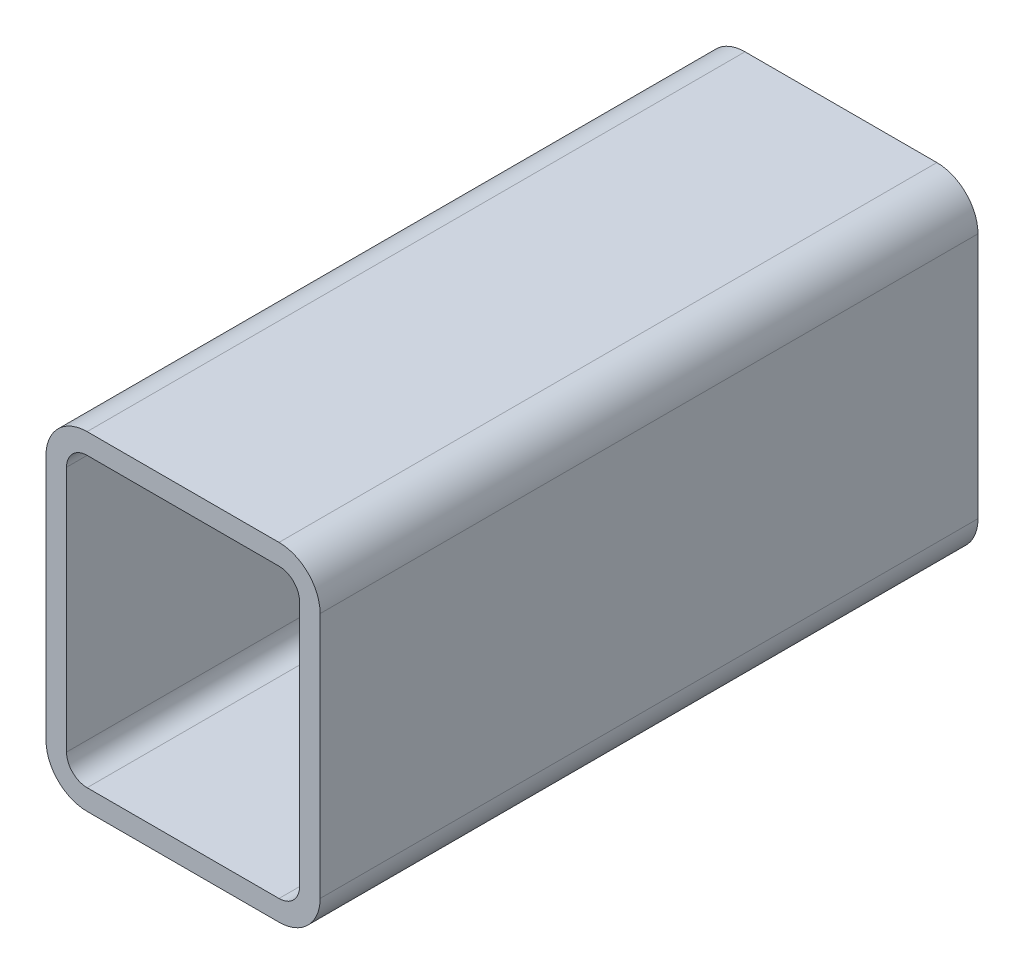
ISO-10303-21;
HEADER;
FILE_DESCRIPTION(('STEP AP214'),'2;1');
FILE_NAME('part.step','',(''),(''),'','','');
FILE_SCHEMA(('AUTOMOTIVE_DESIGN { 1 0 10303 214 1 1 1 1 }'));
ENDSEC;
DATA;
#1=APPLICATION_CONTEXT('core data for automotive mechanical design processes');
#2=APPLICATION_PROTOCOL_DEFINITION('international standard','automotive_design',2000,#1);
#3=PRODUCT_CONTEXT('',#1,'mechanical');
#4=PRODUCT('Part','Part','',(#3));
#5=PRODUCT_RELATED_PRODUCT_CATEGORY('part','',(#4));
#6=PRODUCT_DEFINITION_FORMATION('','',#4);
#7=PRODUCT_DEFINITION_CONTEXT('part definition',#1,'design');
#8=PRODUCT_DEFINITION('design','',#6,#7);
#9=PRODUCT_DEFINITION_SHAPE('','',#8);
#10=(LENGTH_UNIT() NAMED_UNIT(*) SI_UNIT(.MILLI.,.METRE.));
#11=(NAMED_UNIT(*) PLANE_ANGLE_UNIT() SI_UNIT($,.RADIAN.));
#12=(NAMED_UNIT(*) SI_UNIT($,.STERADIAN.) SOLID_ANGLE_UNIT());
#13=UNCERTAINTY_MEASURE_WITH_UNIT(LENGTH_MEASURE(1.E-05),#10,'distance_accuracy_value','');
#14=(GEOMETRIC_REPRESENTATION_CONTEXT(3) GLOBAL_UNCERTAINTY_ASSIGNED_CONTEXT((#13)) GLOBAL_UNIT_ASSIGNED_CONTEXT((#10,
#11,#12)) REPRESENTATION_CONTEXT('',''));
#15=CARTESIAN_POINT('',(0.,0.,0.));
#16=DIRECTION('',(0.,0.,1.));
#17=DIRECTION('',(1.,0.,0.));
#18=AXIS2_PLACEMENT_3D('',#15,#16,#17);
#19=CARTESIAN_POINT('',(19.9112396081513,135.361948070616,304.8));
#20=DIRECTION('',(0.,0.,1.));
#21=DIRECTION('',(1.,0.,0.));
#22=AXIS2_PLACEMENT_3D('',#19,#20,#21);
#23=PLANE('',#22);
#24=CARTESIAN_POINT('',(19.9112396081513,135.361948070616,304.8));
#25=DIRECTION('',(0.,0.,1.));
#26=DIRECTION('',(1.,0.,0.));
#27=AXIS2_PLACEMENT_3D('',#24,#25,#26);
#28=CIRCLE('',#27,19.05);
#29=CARTESIAN_POINT('',(19.9112396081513,154.411948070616,304.8));
#30=VERTEX_POINT('',#29);
#31=CARTESIAN_POINT('',(0.8612396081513,135.361948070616,304.8));
#32=VERTEX_POINT('',#31);
#33=EDGE_CURVE('E211',#30,#32,#28,.T.);
#34=ORIENTED_EDGE('',*,*,#33,.T.);
#35=DIRECTION('',(0.,-1.,0.));
#36=VECTOR('',#35,1.);
#37=CARTESIAN_POINT('',(0.8612396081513,21.0619480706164,304.8));
#38=LINE('',#37,#36);
#39=CARTESIAN_POINT('',(0.8612396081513,21.0619480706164,304.8));
#40=VERTEX_POINT('',#39);
#41=EDGE_CURVE('E214',#32,#40,#38,.T.);
#42=ORIENTED_EDGE('',*,*,#41,.T.);
#43=CARTESIAN_POINT('',(19.9112396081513,21.0619480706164,304.8));
#44=DIRECTION('',(0.,0.,1.));
#45=DIRECTION('',(1.,0.,0.));
#46=AXIS2_PLACEMENT_3D('',#43,#44,#45);
#47=CIRCLE('',#46,19.05);
#48=CARTESIAN_POINT('',(19.9112396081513,2.01194807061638,304.8));
#49=VERTEX_POINT('',#48);
#50=EDGE_CURVE('E217',#40,#49,#47,.T.);
#51=ORIENTED_EDGE('',*,*,#50,.T.);
#52=DIRECTION('',(1.,0.,0.));
#53=VECTOR('',#52,1.);
#54=CARTESIAN_POINT('',(108.811239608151,2.01194807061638,304.8));
#55=LINE('',#54,#53);
#56=CARTESIAN_POINT('',(108.811239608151,2.01194807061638,304.8));
#57=VERTEX_POINT('',#56);
#58=EDGE_CURVE('E219',#49,#57,#55,.T.);
#59=ORIENTED_EDGE('',*,*,#58,.T.);
#60=CARTESIAN_POINT('',(108.811239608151,21.0619480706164,304.8));
#61=DIRECTION('',(0.,0.,1.));
#62=DIRECTION('',(1.,0.,0.));
#63=AXIS2_PLACEMENT_3D('',#60,#61,#62);
#64=CIRCLE('',#63,19.05);
#65=CARTESIAN_POINT('',(127.861239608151,21.0619480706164,304.8));
#66=VERTEX_POINT('',#65);
#67=EDGE_CURVE('E221',#57,#66,#64,.T.);
#68=ORIENTED_EDGE('',*,*,#67,.T.);
#69=DIRECTION('',(0.,1.,0.));
#70=VECTOR('',#69,1.);
#71=CARTESIAN_POINT('',(127.861239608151,135.361948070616,304.8));
#72=LINE('',#71,#70);
#73=CARTESIAN_POINT('',(127.861239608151,135.361948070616,304.8));
#74=VERTEX_POINT('',#73);
#75=EDGE_CURVE('E223',#66,#74,#72,.T.);
#76=ORIENTED_EDGE('',*,*,#75,.T.);
#77=CARTESIAN_POINT('',(108.811239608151,135.361948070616,304.8));
#78=DIRECTION('',(0.,0.,1.));
#79=DIRECTION('',(1.,0.,0.));
#80=AXIS2_PLACEMENT_3D('',#77,#78,#79);
#81=CIRCLE('',#80,19.05);
#82=CARTESIAN_POINT('',(108.811239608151,154.411948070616,304.8));
#83=VERTEX_POINT('',#82);
#84=EDGE_CURVE('E225',#74,#83,#81,.T.);
#85=ORIENTED_EDGE('',*,*,#84,.T.);
#86=DIRECTION('',(-1.,0.,0.));
#87=VECTOR('',#86,1.);
#88=CARTESIAN_POINT('',(19.9112396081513,154.411948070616,304.8));
#89=LINE('',#88,#87);
#90=EDGE_CURVE('E227',#83,#30,#89,.T.);
#91=ORIENTED_EDGE('',*,*,#90,.T.);
#92=EDGE_LOOP('',(#34,#42,#51,#59,#68,#76,#85,#91));
#93=FACE_BOUND('',#92,.T.);
#94=DIRECTION('',(0.,-1.,0.));
#95=VECTOR('',#94,1.);
#96=CARTESIAN_POINT('',(10.3862396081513,21.0619480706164,304.8));
#97=LINE('',#96,#95);
#98=CARTESIAN_POINT('',(10.3862396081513,135.361948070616,304.8));
#99=VERTEX_POINT('',#98);
#100=CARTESIAN_POINT('',(10.3862396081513,21.0619480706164,304.8));
#101=VERTEX_POINT('',#100);
#102=EDGE_CURVE('E154',#99,#101,#97,.T.);
#103=ORIENTED_EDGE('',*,*,#102,.F.);
#104=CARTESIAN_POINT('',(19.9112396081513,135.361948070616,304.8));
#105=DIRECTION('',(0.,0.,1.));
#106=DIRECTION('',(1.,0.,0.));
#107=AXIS2_PLACEMENT_3D('',#104,#105,#106);
#108=CIRCLE('',#107,9.52499999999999);
#109=CARTESIAN_POINT('',(19.9112396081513,144.886948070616,304.8));
#110=VERTEX_POINT('',#109);
#111=EDGE_CURVE('E146',#110,#99,#108,.T.);
#112=ORIENTED_EDGE('',*,*,#111,.F.);
#113=DIRECTION('',(-1.,0.,0.));
#114=VECTOR('',#113,1.);
#115=CARTESIAN_POINT('',(19.9112396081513,144.886948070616,304.8));
#116=LINE('',#115,#114);
#117=CARTESIAN_POINT('',(108.811239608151,144.886948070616,304.8));
#118=VERTEX_POINT('',#117);
#119=EDGE_CURVE('E179',#118,#110,#116,.T.);
#120=ORIENTED_EDGE('',*,*,#119,.F.);
#121=CARTESIAN_POINT('',(108.811239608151,135.361948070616,304.8));
#122=DIRECTION('',(0.,0.,1.));
#123=DIRECTION('',(1.,0.,0.));
#124=AXIS2_PLACEMENT_3D('',#121,#122,#123);
#125=CIRCLE('',#124,9.525);
#126=CARTESIAN_POINT('',(118.336239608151,135.361948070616,304.8));
#127=VERTEX_POINT('',#126);
#128=EDGE_CURVE('E177',#127,#118,#125,.T.);
#129=ORIENTED_EDGE('',*,*,#128,.F.);
#130=DIRECTION('',(0.,1.,0.));
#131=VECTOR('',#130,1.);
#132=CARTESIAN_POINT('',(118.336239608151,135.361948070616,304.8));
#133=LINE('',#132,#131);
#134=CARTESIAN_POINT('',(118.336239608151,21.0619480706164,304.8));
#135=VERTEX_POINT('',#134);
#136=EDGE_CURVE('E175',#135,#127,#133,.T.);
#137=ORIENTED_EDGE('',*,*,#136,.F.);
#138=CARTESIAN_POINT('',(108.811239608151,21.0619480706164,304.8));
#139=DIRECTION('',(0.,0.,1.));
#140=DIRECTION('',(1.,0.,0.));
#141=AXIS2_PLACEMENT_3D('',#138,#139,#140);
#142=CIRCLE('',#141,9.52500000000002);
#143=CARTESIAN_POINT('',(108.811239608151,11.5369480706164,304.8));
#144=VERTEX_POINT('',#143);
#145=EDGE_CURVE('E173',#144,#135,#142,.T.);
#146=ORIENTED_EDGE('',*,*,#145,.F.);
#147=DIRECTION('',(1.,0.,0.));
#148=VECTOR('',#147,1.);
#149=CARTESIAN_POINT('',(108.811239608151,11.5369480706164,304.8));
#150=LINE('',#149,#148);
#151=CARTESIAN_POINT('',(19.9112396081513,11.5369480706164,304.8));
#152=VERTEX_POINT('',#151);
#153=EDGE_CURVE('E169',#152,#144,#150,.T.);
#154=ORIENTED_EDGE('',*,*,#153,.F.);
#155=CARTESIAN_POINT('',(19.9112396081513,21.0619480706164,304.8));
#156=DIRECTION('',(0.,0.,1.));
#157=DIRECTION('',(1.,0.,0.));
#158=AXIS2_PLACEMENT_3D('',#155,#156,#157);
#159=CIRCLE('',#158,9.52500000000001);
#160=EDGE_CURVE('E167',#101,#152,#159,.T.);
#161=ORIENTED_EDGE('',*,*,#160,.F.);
#162=EDGE_LOOP('',(#103,#112,#120,#129,#137,#146,#154,#161));
#163=FACE_BOUND('',#162,.T.);
#164=ADVANCED_FACE('F33',(#93,#163),#23,.T.);
#165=CARTESIAN_POINT('',(19.9112396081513,135.361948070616,0.));
#166=DIRECTION('',(0.,0.,1.));
#167=DIRECTION('',(1.,0.,0.));
#168=AXIS2_PLACEMENT_3D('',#165,#166,#167);
#169=PLANE('',#168);
#170=CARTESIAN_POINT('',(19.9112396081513,135.361948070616,0.));
#171=DIRECTION('',(0.,0.,1.));
#172=DIRECTION('',(1.,0.,0.));
#173=AXIS2_PLACEMENT_3D('',#170,#171,#172);
#174=CIRCLE('',#173,19.05);
#175=CARTESIAN_POINT('',(19.9112396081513,154.411948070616,0.));
#176=VERTEX_POINT('',#175);
#177=CARTESIAN_POINT('',(0.8612396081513,135.361948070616,0.));
#178=VERTEX_POINT('',#177);
#179=EDGE_CURVE('E162',#176,#178,#174,.T.);
#180=ORIENTED_EDGE('',*,*,#179,.F.);
#181=DIRECTION('',(-1.,0.,0.));
#182=VECTOR('',#181,1.);
#183=CARTESIAN_POINT('',(19.9112396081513,154.411948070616,0.));
#184=LINE('',#183,#182);
#185=CARTESIAN_POINT('',(108.811239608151,154.411948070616,0.));
#186=VERTEX_POINT('',#185);
#187=EDGE_CURVE('E215',#186,#176,#184,.T.);
#188=ORIENTED_EDGE('',*,*,#187,.F.);
#189=CARTESIAN_POINT('',(108.811239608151,135.361948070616,0.));
#190=DIRECTION('',(0.,0.,1.));
#191=DIRECTION('',(1.,0.,0.));
#192=AXIS2_PLACEMENT_3D('',#189,#190,#191);
#193=CIRCLE('',#192,19.05);
#194=CARTESIAN_POINT('',(127.861239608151,135.361948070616,0.));
#195=VERTEX_POINT('',#194);
#196=EDGE_CURVE('E242',#195,#186,#193,.T.);
#197=ORIENTED_EDGE('',*,*,#196,.F.);
#198=DIRECTION('',(0.,1.,0.));
#199=VECTOR('',#198,1.);
#200=CARTESIAN_POINT('',(127.861239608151,135.361948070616,0.));
#201=LINE('',#200,#199);
#202=CARTESIAN_POINT('',(127.861239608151,21.0619480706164,0.));
#203=VERTEX_POINT('',#202);
#204=EDGE_CURVE('E240',#203,#195,#201,.T.);
#205=ORIENTED_EDGE('',*,*,#204,.F.);
#206=CARTESIAN_POINT('',(108.811239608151,21.0619480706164,0.));
#207=DIRECTION('',(0.,0.,1.));
#208=DIRECTION('',(1.,0.,0.));
#209=AXIS2_PLACEMENT_3D('',#206,#207,#208);
#210=CIRCLE('',#209,19.05);
#211=CARTESIAN_POINT('',(108.811239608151,2.01194807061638,0.));
#212=VERTEX_POINT('',#211);
#213=EDGE_CURVE('E238',#212,#203,#210,.T.);
#214=ORIENTED_EDGE('',*,*,#213,.F.);
#215=DIRECTION('',(1.,0.,0.));
#216=VECTOR('',#215,1.);
#217=CARTESIAN_POINT('',(108.811239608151,2.01194807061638,0.));
#218=LINE('',#217,#216);
#219=CARTESIAN_POINT('',(19.9112396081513,2.01194807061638,0.));
#220=VERTEX_POINT('',#219);
#221=EDGE_CURVE('E236',#220,#212,#218,.T.);
#222=ORIENTED_EDGE('',*,*,#221,.F.);
#223=CARTESIAN_POINT('',(19.9112396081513,21.0619480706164,0.));
#224=DIRECTION('',(0.,0.,1.));
#225=DIRECTION('',(1.,0.,0.));
#226=AXIS2_PLACEMENT_3D('',#223,#224,#225);
#227=CIRCLE('',#226,19.05);
#228=CARTESIAN_POINT('',(0.8612396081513,21.0619480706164,0.));
#229=VERTEX_POINT('',#228);
#230=EDGE_CURVE('E234',#229,#220,#227,.T.);
#231=ORIENTED_EDGE('',*,*,#230,.F.);
#232=DIRECTION('',(0.,-1.,0.));
#233=VECTOR('',#232,1.);
#234=CARTESIAN_POINT('',(0.8612396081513,21.0619480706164,0.));
#235=LINE('',#234,#233);
#236=EDGE_CURVE('E232',#178,#229,#235,.T.);
#237=ORIENTED_EDGE('',*,*,#236,.F.);
#238=EDGE_LOOP('',(#180,#188,#197,#205,#214,#222,#231,#237));
#239=FACE_BOUND('',#238,.T.);
#240=CARTESIAN_POINT('',(19.9112396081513,135.361948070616,0.));
#241=DIRECTION('',(0.,0.,1.));
#242=DIRECTION('',(1.,0.,0.));
#243=AXIS2_PLACEMENT_3D('',#240,#241,#242);
#244=CIRCLE('',#243,9.52499999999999);
#245=CARTESIAN_POINT('',(19.9112396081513,144.886948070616,0.));
#246=VERTEX_POINT('',#245);
#247=CARTESIAN_POINT('',(10.3862396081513,135.361948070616,0.));
#248=VERTEX_POINT('',#247);
#249=EDGE_CURVE('E56',#246,#248,#244,.T.);
#250=ORIENTED_EDGE('',*,*,#249,.T.);
#251=DIRECTION('',(0.,-1.,0.));
#252=VECTOR('',#251,1.);
#253=CARTESIAN_POINT('',(10.3862396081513,21.0619480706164,0.));
#254=LINE('',#253,#252);
#255=CARTESIAN_POINT('',(10.3862396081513,21.0619480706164,0.));
#256=VERTEX_POINT('',#255);
#257=EDGE_CURVE('E161',#248,#256,#254,.T.);
#258=ORIENTED_EDGE('',*,*,#257,.T.);
#259=CARTESIAN_POINT('',(19.9112396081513,21.0619480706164,0.));
#260=DIRECTION('',(0.,0.,1.));
#261=DIRECTION('',(1.,0.,0.));
#262=AXIS2_PLACEMENT_3D('',#259,#260,#261);
#263=CIRCLE('',#262,9.52500000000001);
#264=CARTESIAN_POINT('',(19.9112396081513,11.5369480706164,0.));
#265=VERTEX_POINT('',#264);
#266=EDGE_CURVE('E183',#256,#265,#263,.T.);
#267=ORIENTED_EDGE('',*,*,#266,.T.);
#268=DIRECTION('',(1.,0.,0.));
#269=VECTOR('',#268,1.);
#270=CARTESIAN_POINT('',(108.811239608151,11.5369480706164,0.));
#271=LINE('',#270,#269);
#272=CARTESIAN_POINT('',(108.811239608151,11.5369480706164,0.));
#273=VERTEX_POINT('',#272);
#274=EDGE_CURVE('E186',#265,#273,#271,.T.);
#275=ORIENTED_EDGE('',*,*,#274,.T.);
#276=CARTESIAN_POINT('',(108.811239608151,21.0619480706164,0.));
#277=DIRECTION('',(0.,0.,1.));
#278=DIRECTION('',(1.,0.,0.));
#279=AXIS2_PLACEMENT_3D('',#276,#277,#278);
#280=CIRCLE('',#279,9.52500000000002);
#281=CARTESIAN_POINT('',(118.336239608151,21.0619480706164,0.));
#282=VERTEX_POINT('',#281);
#283=EDGE_CURVE('E189',#273,#282,#280,.T.);
#284=ORIENTED_EDGE('',*,*,#283,.T.);
#285=DIRECTION('',(0.,1.,0.));
#286=VECTOR('',#285,1.);
#287=CARTESIAN_POINT('',(118.336239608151,135.361948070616,0.));
#288=LINE('',#287,#286);
#289=CARTESIAN_POINT('',(118.336239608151,135.361948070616,0.));
#290=VERTEX_POINT('',#289);
#291=EDGE_CURVE('E192',#282,#290,#288,.T.);
#292=ORIENTED_EDGE('',*,*,#291,.T.);
#293=CARTESIAN_POINT('',(108.811239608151,135.361948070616,0.));
#294=DIRECTION('',(0.,0.,1.));
#295=DIRECTION('',(1.,0.,0.));
#296=AXIS2_PLACEMENT_3D('',#293,#294,#295);
#297=CIRCLE('',#296,9.525);
#298=CARTESIAN_POINT('',(108.811239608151,144.886948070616,0.));
#299=VERTEX_POINT('',#298);
#300=EDGE_CURVE('E195',#290,#299,#297,.T.);
#301=ORIENTED_EDGE('',*,*,#300,.T.);
#302=DIRECTION('',(-1.,0.,0.));
#303=VECTOR('',#302,1.);
#304=CARTESIAN_POINT('',(19.9112396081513,144.886948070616,0.));
#305=LINE('',#304,#303);
#306=EDGE_CURVE('E155',#299,#246,#305,.T.);
#307=ORIENTED_EDGE('',*,*,#306,.T.);
#308=EDGE_LOOP('',(#250,#258,#267,#275,#284,#292,#301,#307));
#309=FACE_BOUND('',#308,.T.);
#310=ADVANCED_FACE('F272',(#239,#309),#169,.F.);
#311=CARTESIAN_POINT('',(19.9112396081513,135.361948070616,304.8));
#312=DIRECTION('',(0.,0.,-1.));
#313=DIRECTION('',(-1.,0.,0.));
#314=AXIS2_PLACEMENT_3D('',#311,#312,#313);
#315=CYLINDRICAL_SURFACE('',#314,19.05);
#316=ORIENTED_EDGE('',*,*,#179,.T.);
#317=DIRECTION('',(0.,0.,-1.));
#318=VECTOR('',#317,1.);
#319=CARTESIAN_POINT('',(0.8612396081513,135.361948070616,304.8));
#320=LINE('',#319,#318);
#321=EDGE_CURVE('E11',#32,#178,#320,.T.);
#322=ORIENTED_EDGE('',*,*,#321,.F.);
#323=ORIENTED_EDGE('',*,*,#33,.F.);
#324=DIRECTION('',(0.,0.,-1.));
#325=VECTOR('',#324,1.);
#326=CARTESIAN_POINT('',(19.9112396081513,154.411948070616,304.8));
#327=LINE('',#326,#325);
#328=EDGE_CURVE('E229',#30,#176,#327,.T.);
#329=ORIENTED_EDGE('',*,*,#328,.T.);
#330=EDGE_LOOP('',(#316,#322,#323,#329));
#331=FACE_BOUND('',#330,.T.);
#332=ADVANCED_FACE('F35',(#331),#315,.T.);
#333=CARTESIAN_POINT('',(0.8612396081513,21.0619480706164,304.8));
#334=DIRECTION('',(1.,0.,0.));
#335=DIRECTION('',(0.,0.,-1.));
#336=AXIS2_PLACEMENT_3D('',#333,#334,#335);
#337=PLANE('',#336);
#338=ORIENTED_EDGE('',*,*,#236,.T.);
#339=DIRECTION('',(0.,0.,-1.));
#340=VECTOR('',#339,1.);
#341=CARTESIAN_POINT('',(0.8612396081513,21.0619480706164,304.8));
#342=LINE('',#341,#340);
#343=EDGE_CURVE('E41',#40,#229,#342,.T.);
#344=ORIENTED_EDGE('',*,*,#343,.F.);
#345=ORIENTED_EDGE('',*,*,#41,.F.);
#346=ORIENTED_EDGE('',*,*,#321,.T.);
#347=EDGE_LOOP('',(#338,#344,#345,#346));
#348=FACE_BOUND('',#347,.T.);
#349=ADVANCED_FACE('F289',(#348),#337,.F.);
#350=CARTESIAN_POINT('',(19.9112396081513,21.0619480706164,304.8));
#351=DIRECTION('',(0.,0.,-1.));
#352=DIRECTION('',(-1.,0.,0.));
#353=AXIS2_PLACEMENT_3D('',#350,#351,#352);
#354=CYLINDRICAL_SURFACE('',#353,19.05);
#355=ORIENTED_EDGE('',*,*,#230,.T.);
#356=DIRECTION('',(0.,0.,-1.));
#357=VECTOR('',#356,1.);
#358=CARTESIAN_POINT('',(19.9112396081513,2.01194807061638,304.8));
#359=LINE('',#358,#357);
#360=EDGE_CURVE('E259',#49,#220,#359,.T.);
#361=ORIENTED_EDGE('',*,*,#360,.F.);
#362=ORIENTED_EDGE('',*,*,#50,.F.);
#363=ORIENTED_EDGE('',*,*,#343,.T.);
#364=EDGE_LOOP('',(#355,#361,#362,#363));
#365=FACE_BOUND('',#364,.T.);
#366=ADVANCED_FACE('F266',(#365),#354,.T.);
#367=CARTESIAN_POINT('',(108.811239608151,2.01194807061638,304.8));
#368=DIRECTION('',(0.,1.,0.));
#369=DIRECTION('',(0.,0.,1.));
#370=AXIS2_PLACEMENT_3D('',#367,#368,#369);
#371=PLANE('',#370);
#372=ORIENTED_EDGE('',*,*,#221,.T.);
#373=DIRECTION('',(0.,0.,-1.));
#374=VECTOR('',#373,1.);
#375=CARTESIAN_POINT('',(108.811239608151,2.01194807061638,304.8));
#376=LINE('',#375,#374);
#377=EDGE_CURVE('E256',#57,#212,#376,.T.);
#378=ORIENTED_EDGE('',*,*,#377,.F.);
#379=ORIENTED_EDGE('',*,*,#58,.F.);
#380=ORIENTED_EDGE('',*,*,#360,.T.);
#381=EDGE_LOOP('',(#372,#378,#379,#380));
#382=FACE_BOUND('',#381,.T.);
#383=ADVANCED_FACE('F278',(#382),#371,.F.);
#384=CARTESIAN_POINT('',(108.811239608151,21.0619480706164,304.8));
#385=DIRECTION('',(0.,0.,-1.));
#386=DIRECTION('',(-1.,0.,0.));
#387=AXIS2_PLACEMENT_3D('',#384,#385,#386);
#388=CYLINDRICAL_SURFACE('',#387,19.05);
#389=ORIENTED_EDGE('',*,*,#213,.T.);
#390=DIRECTION('',(0.,0.,-1.));
#391=VECTOR('',#390,1.);
#392=CARTESIAN_POINT('',(127.861239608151,21.0619480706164,304.8));
#393=LINE('',#392,#391);
#394=EDGE_CURVE('E253',#66,#203,#393,.T.);
#395=ORIENTED_EDGE('',*,*,#394,.F.);
#396=ORIENTED_EDGE('',*,*,#67,.F.);
#397=ORIENTED_EDGE('',*,*,#377,.T.);
#398=EDGE_LOOP('',(#389,#395,#396,#397));
#399=FACE_BOUND('',#398,.T.);
#400=ADVANCED_FACE('F282',(#399),#388,.T.);
#401=CARTESIAN_POINT('',(127.861239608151,135.361948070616,304.8));
#402=DIRECTION('',(-1.,0.,0.));
#403=DIRECTION('',(0.,0.,1.));
#404=AXIS2_PLACEMENT_3D('',#401,#402,#403);
#405=PLANE('',#404);
#406=ORIENTED_EDGE('',*,*,#204,.T.);
#407=DIRECTION('',(0.,0.,-1.));
#408=VECTOR('',#407,1.);
#409=CARTESIAN_POINT('',(127.861239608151,135.361948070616,304.8));
#410=LINE('',#409,#408);
#411=EDGE_CURVE('E250',#74,#195,#410,.T.);
#412=ORIENTED_EDGE('',*,*,#411,.F.);
#413=ORIENTED_EDGE('',*,*,#75,.F.);
#414=ORIENTED_EDGE('',*,*,#394,.T.);
#415=EDGE_LOOP('',(#406,#412,#413,#414));
#416=FACE_BOUND('',#415,.T.);
#417=ADVANCED_FACE('F302',(#416),#405,.F.);
#418=CARTESIAN_POINT('',(108.811239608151,135.361948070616,304.8));
#419=DIRECTION('',(0.,0.,-1.));
#420=DIRECTION('',(-1.,0.,0.));
#421=AXIS2_PLACEMENT_3D('',#418,#419,#420);
#422=CYLINDRICAL_SURFACE('',#421,19.05);
#423=ORIENTED_EDGE('',*,*,#196,.T.);
#424=DIRECTION('',(0.,0.,-1.));
#425=VECTOR('',#424,1.);
#426=CARTESIAN_POINT('',(108.811239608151,154.411948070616,304.8));
#427=LINE('',#426,#425);
#428=EDGE_CURVE('E247',#83,#186,#427,.T.);
#429=ORIENTED_EDGE('',*,*,#428,.F.);
#430=ORIENTED_EDGE('',*,*,#84,.F.);
#431=ORIENTED_EDGE('',*,*,#411,.T.);
#432=EDGE_LOOP('',(#423,#429,#430,#431));
#433=FACE_BOUND('',#432,.T.);
#434=ADVANCED_FACE('F300',(#433),#422,.T.);
#435=CARTESIAN_POINT('',(19.9112396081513,154.411948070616,304.8));
#436=DIRECTION('',(0.,-1.,0.));
#437=DIRECTION('',(0.,0.,-1.));
#438=AXIS2_PLACEMENT_3D('',#435,#436,#437);
#439=PLANE('',#438);
#440=ORIENTED_EDGE('',*,*,#187,.T.);
#441=ORIENTED_EDGE('',*,*,#328,.F.);
#442=ORIENTED_EDGE('',*,*,#90,.F.);
#443=ORIENTED_EDGE('',*,*,#428,.T.);
#444=EDGE_LOOP('',(#440,#441,#442,#443));
#445=FACE_BOUND('',#444,.T.);
#446=ADVANCED_FACE('F295',(#445),#439,.F.);
#447=CARTESIAN_POINT('',(19.9112396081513,135.361948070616,304.8));
#448=DIRECTION('',(0.,0.,-1.));
#449=DIRECTION('',(-1.,0.,0.));
#450=AXIS2_PLACEMENT_3D('',#447,#448,#449);
#451=CYLINDRICAL_SURFACE('',#450,9.52499999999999);
#452=ORIENTED_EDGE('',*,*,#249,.F.);
#453=DIRECTION('',(0.,0.,-1.));
#454=VECTOR('',#453,1.);
#455=CARTESIAN_POINT('',(19.9112396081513,144.886948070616,304.8));
#456=LINE('',#455,#454);
#457=EDGE_CURVE('E150',#110,#246,#456,.T.);
#458=ORIENTED_EDGE('',*,*,#457,.F.);
#459=ORIENTED_EDGE('',*,*,#111,.T.);
#460=DIRECTION('',(0.,0.,-1.));
#461=VECTOR('',#460,1.);
#462=CARTESIAN_POINT('',(10.3862396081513,135.361948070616,304.8));
#463=LINE('',#462,#461);
#464=EDGE_CURVE('E149',#99,#248,#463,.T.);
#465=ORIENTED_EDGE('',*,*,#464,.T.);
#466=EDGE_LOOP('',(#452,#458,#459,#465));
#467=FACE_BOUND('',#466,.T.);
#468=ADVANCED_FACE('F148',(#467),#451,.F.);
#469=CARTESIAN_POINT('',(10.3862396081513,21.0619480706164,304.8));
#470=DIRECTION('',(1.,0.,0.));
#471=DIRECTION('',(0.,0.,-1.));
#472=AXIS2_PLACEMENT_3D('',#469,#470,#471);
#473=PLANE('',#472);
#474=ORIENTED_EDGE('',*,*,#257,.F.);
#475=ORIENTED_EDGE('',*,*,#464,.F.);
#476=ORIENTED_EDGE('',*,*,#102,.T.);
#477=DIRECTION('',(0.,0.,-1.));
#478=VECTOR('',#477,1.);
#479=CARTESIAN_POINT('',(10.3862396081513,21.0619480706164,304.8));
#480=LINE('',#479,#478);
#481=EDGE_CURVE('E163',#101,#256,#480,.T.);
#482=ORIENTED_EDGE('',*,*,#481,.T.);
#483=EDGE_LOOP('',(#474,#475,#476,#482));
#484=FACE_BOUND('',#483,.T.);
#485=ADVANCED_FACE('F158',(#484),#473,.T.);
#486=CARTESIAN_POINT('',(19.9112396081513,21.0619480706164,304.8));
#487=DIRECTION('',(0.,0.,-1.));
#488=DIRECTION('',(-1.,0.,0.));
#489=AXIS2_PLACEMENT_3D('',#486,#487,#488);
#490=CYLINDRICAL_SURFACE('',#489,9.52500000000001);
#491=ORIENTED_EDGE('',*,*,#266,.F.);
#492=ORIENTED_EDGE('',*,*,#481,.F.);
#493=ORIENTED_EDGE('',*,*,#160,.T.);
#494=DIRECTION('',(0.,0.,-1.));
#495=VECTOR('',#494,1.);
#496=CARTESIAN_POINT('',(19.9112396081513,11.5369480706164,304.8));
#497=LINE('',#496,#495);
#498=EDGE_CURVE('E208',#152,#265,#497,.T.);
#499=ORIENTED_EDGE('',*,*,#498,.T.);
#500=EDGE_LOOP('',(#491,#492,#493,#499));
#501=FACE_BOUND('',#500,.T.);
#502=ADVANCED_FACE('F327',(#501),#490,.F.);
#503=CARTESIAN_POINT('',(108.811239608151,11.5369480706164,304.8));
#504=DIRECTION('',(0.,1.,0.));
#505=DIRECTION('',(0.,0.,1.));
#506=AXIS2_PLACEMENT_3D('',#503,#504,#505);
#507=PLANE('',#506);
#508=ORIENTED_EDGE('',*,*,#274,.F.);
#509=ORIENTED_EDGE('',*,*,#498,.F.);
#510=ORIENTED_EDGE('',*,*,#153,.T.);
#511=DIRECTION('',(0.,0.,-1.));
#512=VECTOR('',#511,1.);
#513=CARTESIAN_POINT('',(108.811239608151,11.5369480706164,304.8));
#514=LINE('',#513,#512);
#515=EDGE_CURVE('E206',#144,#273,#514,.T.);
#516=ORIENTED_EDGE('',*,*,#515,.T.);
#517=EDGE_LOOP('',(#508,#509,#510,#516));
#518=FACE_BOUND('',#517,.T.);
#519=ADVANCED_FACE('F331',(#518),#507,.T.);
#520=CARTESIAN_POINT('',(108.811239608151,21.0619480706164,304.8));
#521=DIRECTION('',(0.,0.,-1.));
#522=DIRECTION('',(-1.,0.,0.));
#523=AXIS2_PLACEMENT_3D('',#520,#521,#522);
#524=CYLINDRICAL_SURFACE('',#523,9.52500000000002);
#525=ORIENTED_EDGE('',*,*,#283,.F.);
#526=ORIENTED_EDGE('',*,*,#515,.F.);
#527=ORIENTED_EDGE('',*,*,#145,.T.);
#528=DIRECTION('',(0.,0.,-1.));
#529=VECTOR('',#528,1.);
#530=CARTESIAN_POINT('',(118.336239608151,21.0619480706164,304.8));
#531=LINE('',#530,#529);
#532=EDGE_CURVE('E204',#135,#282,#531,.T.);
#533=ORIENTED_EDGE('',*,*,#532,.T.);
#534=EDGE_LOOP('',(#525,#526,#527,#533));
#535=FACE_BOUND('',#534,.T.);
#536=ADVANCED_FACE('F337',(#535),#524,.F.);
#537=CARTESIAN_POINT('',(118.336239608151,135.361948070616,304.8));
#538=DIRECTION('',(-1.,0.,0.));
#539=DIRECTION('',(0.,0.,1.));
#540=AXIS2_PLACEMENT_3D('',#537,#538,#539);
#541=PLANE('',#540);
#542=ORIENTED_EDGE('',*,*,#291,.F.);
#543=ORIENTED_EDGE('',*,*,#532,.F.);
#544=ORIENTED_EDGE('',*,*,#136,.T.);
#545=DIRECTION('',(0.,0.,-1.));
#546=VECTOR('',#545,1.);
#547=CARTESIAN_POINT('',(118.336239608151,135.361948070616,304.8));
#548=LINE('',#547,#546);
#549=EDGE_CURVE('E202',#127,#290,#548,.T.);
#550=ORIENTED_EDGE('',*,*,#549,.T.);
#551=EDGE_LOOP('',(#542,#543,#544,#550));
#552=FACE_BOUND('',#551,.T.);
#553=ADVANCED_FACE('F341',(#552),#541,.T.);
#554=CARTESIAN_POINT('',(108.811239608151,135.361948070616,304.8));
#555=DIRECTION('',(0.,0.,-1.));
#556=DIRECTION('',(-1.,0.,0.));
#557=AXIS2_PLACEMENT_3D('',#554,#555,#556);
#558=CYLINDRICAL_SURFACE('',#557,9.525);
#559=ORIENTED_EDGE('',*,*,#300,.F.);
#560=ORIENTED_EDGE('',*,*,#549,.F.);
#561=ORIENTED_EDGE('',*,*,#128,.T.);
#562=DIRECTION('',(0.,0.,-1.));
#563=VECTOR('',#562,1.);
#564=CARTESIAN_POINT('',(108.811239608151,144.886948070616,304.8));
#565=LINE('',#564,#563);
#566=EDGE_CURVE('E48',#118,#299,#565,.T.);
#567=ORIENTED_EDGE('',*,*,#566,.T.);
#568=EDGE_LOOP('',(#559,#560,#561,#567));
#569=FACE_BOUND('',#568,.T.);
#570=ADVANCED_FACE('F345',(#569),#558,.F.);
#571=CARTESIAN_POINT('',(19.9112396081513,144.886948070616,304.8));
#572=DIRECTION('',(0.,-1.,0.));
#573=DIRECTION('',(0.,0.,-1.));
#574=AXIS2_PLACEMENT_3D('',#571,#572,#573);
#575=PLANE('',#574);
#576=ORIENTED_EDGE('',*,*,#306,.F.);
#577=ORIENTED_EDGE('',*,*,#566,.F.);
#578=ORIENTED_EDGE('',*,*,#119,.T.);
#579=ORIENTED_EDGE('',*,*,#457,.T.);
#580=EDGE_LOOP('',(#576,#577,#578,#579));
#581=FACE_BOUND('',#580,.T.);
#582=ADVANCED_FACE('F349',(#581),#575,.T.);
#583=CLOSED_SHELL('',(#164,#310,#332,#349,#366,#383,#400,#417,#434,#446,#468,#485,#502,#519,
#536,#553,#570,#582));
#584=MANIFOLD_SOLID_BREP('B2',#583);
#585=ADVANCED_BREP_SHAPE_REPRESENTATION('',(#18,#584),#14);
#586=SHAPE_DEFINITION_REPRESENTATION(#9,#585);
ENDSEC;
END-ISO-10303-21;
